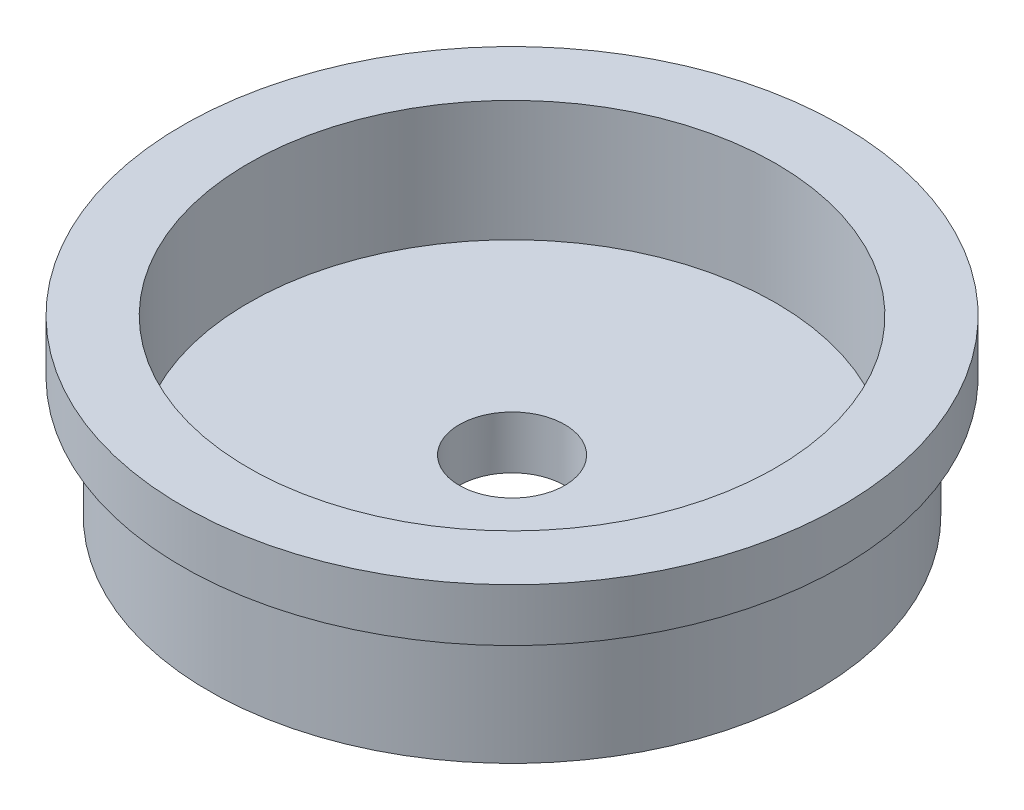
from build123d import *

# Parameters (mm, degrees)
ESQUISSE2_R             = 1
ENL_V_MAT_EXTRU_1_DEPTH = 10


with BuildPart() as part:
    # Esquisse1 → R_volution1 (revolve)
    with BuildSketch(Plane.XY, mode=Mode.PRIVATE) as r_volution1_sk:
        Polygon((0, 0), (5.75, 0), (5.75, 2), (6.25, 2.28900341), (6.25, 3.28900341), (5, 3.28900341), (5, 1), (0, 1), align=None)
    revolve(r_volution1_sk.sketch.rotate(Axis((0, 0, 0), (0, 1, 0)), 90), axis=Axis((0, 0, 0), (0, 1, 0)))

    # Esquisse2 → Enl_v. mat.-Extru.1 (cut)
    with BuildSketch(Plane(origin=(0, 1, 0), x_dir=(1, 0, 0), z_dir=(0, 1, 0))):
        with Locations(Location((0, 0, 0), (0, 0, 270))):
            Circle(ESQUISSE2_R)
    extrude(amount=-ENL_V_MAT_EXTRU_1_DEPTH, mode=Mode.SUBTRACT)


solid = part.part
